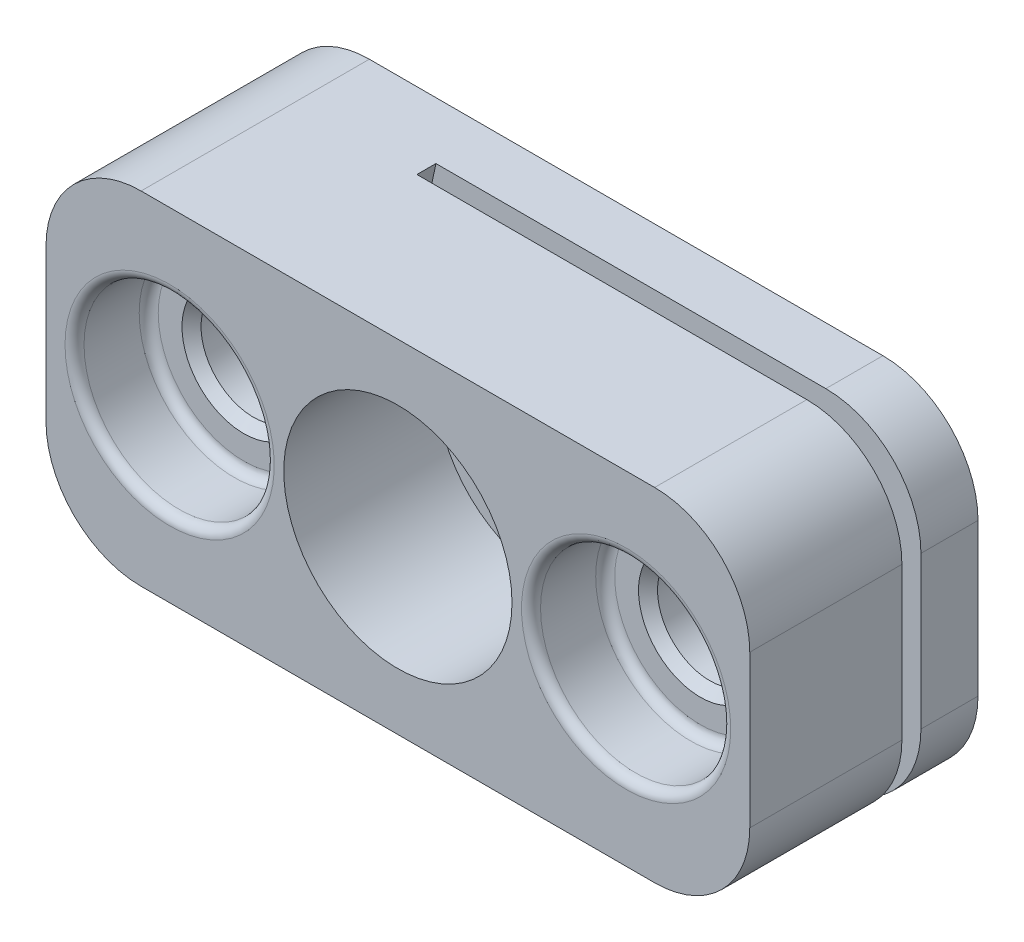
ISO-10303-21;
HEADER;
FILE_DESCRIPTION(('STEP AP214'),'2;1');
FILE_NAME('part.step','',(''),(''),'','','');
FILE_SCHEMA(('AUTOMOTIVE_DESIGN { 1 0 10303 214 1 1 1 1 }'));
ENDSEC;
DATA;
#1=APPLICATION_CONTEXT('core data for automotive mechanical design processes');
#2=APPLICATION_PROTOCOL_DEFINITION('international standard','automotive_design',2000,#1);
#3=PRODUCT_CONTEXT('',#1,'mechanical');
#4=PRODUCT('Part','Part','',(#3));
#5=PRODUCT_RELATED_PRODUCT_CATEGORY('part','',(#4));
#6=PRODUCT_DEFINITION_FORMATION('','',#4);
#7=PRODUCT_DEFINITION_CONTEXT('part definition',#1,'design');
#8=PRODUCT_DEFINITION('design','',#6,#7);
#9=PRODUCT_DEFINITION_SHAPE('','',#8);
#10=(LENGTH_UNIT() NAMED_UNIT(*) SI_UNIT(.MILLI.,.METRE.));
#11=(NAMED_UNIT(*) PLANE_ANGLE_UNIT() SI_UNIT($,.RADIAN.));
#12=(NAMED_UNIT(*) SI_UNIT($,.STERADIAN.) SOLID_ANGLE_UNIT());
#13=UNCERTAINTY_MEASURE_WITH_UNIT(LENGTH_MEASURE(1.E-05),#10,'distance_accuracy_value','');
#14=(GEOMETRIC_REPRESENTATION_CONTEXT(3) GLOBAL_UNCERTAINTY_ASSIGNED_CONTEXT((#13)) GLOBAL_UNIT_ASSIGNED_CONTEXT((#10,
#11,#12)) REPRESENTATION_CONTEXT('',''));
#15=CARTESIAN_POINT('',(0.,0.,0.));
#16=DIRECTION('',(0.,0.,1.));
#17=DIRECTION('',(1.,0.,0.));
#18=AXIS2_PLACEMENT_3D('',#15,#16,#17);
#19=CARTESIAN_POINT('',(27.25,0.,8.1));
#20=DIRECTION('',(0.,0.,1.));
#21=DIRECTION('',(1.,0.,0.));
#22=AXIS2_PLACEMENT_3D('',#19,#20,#21);
#23=PLANE('',#22);
#24=CARTESIAN_POINT('',(24.,0.,8.1000000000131));
#25=DIRECTION('',(0.,0.,1.));
#26=DIRECTION('',(1.,0.,0.));
#27=AXIS2_PLACEMENT_3D('',#24,#25,#26);
#28=CIRCLE('',#27,3.24999999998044);
#29=CARTESIAN_POINT('',(27.2499999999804,0.,8.1000000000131));
#30=VERTEX_POINT('',#29);
#31=EDGE_CURVE('E18',#30,#30,#28,.F.);
#32=ORIENTED_EDGE('',*,*,#31,.T.);
#33=EDGE_LOOP('',(#32));
#34=FACE_BOUND('',#33,.T.);
#35=CARTESIAN_POINT('',(24.,0.,8.09999999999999));
#36=DIRECTION('',(0.,0.,-1.));
#37=DIRECTION('',(1.,0.,0.));
#38=AXIS2_PLACEMENT_3D('',#35,#36,#37);
#39=CIRCLE('',#38,4.50000000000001);
#40=CARTESIAN_POINT('',(28.5,0.,8.09999999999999));
#41=VERTEX_POINT('',#40);
#42=EDGE_CURVE('E285',#41,#41,#39,.F.);
#43=ORIENTED_EDGE('',*,*,#42,.T.);
#44=EDGE_LOOP('',(#43));
#45=FACE_BOUND('',#44,.T.);
#46=ADVANCED_FACE('F14',(#34,#45),#23,.T.);
#47=CARTESIAN_POINT('',(24.,0.,8.6));
#48=DIRECTION('',(0.,0.,1.));
#49=DIRECTION('',(1.,0.,0.));
#50=AXIS2_PLACEMENT_3D('',#47,#48,#49);
#51=TOROIDAL_SURFACE('',#50,4.5,0.500000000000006);
#52=CARTESIAN_POINT('',(24.,0.,8.6));
#53=DIRECTION('',(0.,0.,-1.));
#54=DIRECTION('',(-1.,0.,0.));
#55=AXIS2_PLACEMENT_3D('',#52,#53,#54);
#56=CIRCLE('',#55,5.);
#57=CARTESIAN_POINT('',(19.,0.,8.6));
#58=VERTEX_POINT('',#57);
#59=EDGE_CURVE('E234',#58,#58,#56,.F.);
#60=ORIENTED_EDGE('',*,*,#59,.T.);
#61=EDGE_LOOP('',(#60));
#62=FACE_BOUND('',#61,.T.);
#63=ORIENTED_EDGE('',*,*,#42,.F.);
#64=EDGE_LOOP('',(#63));
#65=FACE_BOUND('',#64,.T.);
#66=ADVANCED_FACE('F267',(#62,#65),#51,.F.);
#67=CARTESIAN_POINT('',(0.,0.,8.6));
#68=DIRECTION('',(0.,0.,-1.));
#69=DIRECTION('',(-1.,0.,0.));
#70=AXIS2_PLACEMENT_3D('',#67,#68,#69);
#71=TOROIDAL_SURFACE('',#70,4.5,0.500000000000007);
#72=CARTESIAN_POINT('',(0.,0.,8.09999999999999));
#73=DIRECTION('',(0.,0.,-1.));
#74=DIRECTION('',(-1.,0.,0.));
#75=AXIS2_PLACEMENT_3D('',#72,#73,#74);
#76=CIRCLE('',#75,4.50000000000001);
#77=CARTESIAN_POINT('',(-4.50000000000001,0.,8.09999999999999));
#78=VERTEX_POINT('',#77);
#79=EDGE_CURVE('E245',#78,#78,#76,.F.);
#80=ORIENTED_EDGE('',*,*,#79,.F.);
#81=EDGE_LOOP('',(#80));
#82=FACE_BOUND('',#81,.T.);
#83=CARTESIAN_POINT('',(0.,0.,8.6));
#84=DIRECTION('',(0.,0.,1.));
#85=DIRECTION('',(1.,0.,0.));
#86=AXIS2_PLACEMENT_3D('',#83,#84,#85);
#87=CIRCLE('',#86,5.);
#88=CARTESIAN_POINT('',(5.,0.,8.6));
#89=VERTEX_POINT('',#88);
#90=EDGE_CURVE('E231',#89,#89,#87,.T.);
#91=ORIENTED_EDGE('',*,*,#90,.T.);
#92=EDGE_LOOP('',(#91));
#93=FACE_BOUND('',#92,.T.);
#94=ADVANCED_FACE('F263',(#82,#93),#71,.F.);
#95=CARTESIAN_POINT('',(-4.5,0.,8.1));
#96=DIRECTION('',(0.,0.,1.));
#97=DIRECTION('',(1.,0.,0.));
#98=AXIS2_PLACEMENT_3D('',#95,#96,#97);
#99=PLANE('',#98);
#100=ORIENTED_EDGE('',*,*,#79,.T.);
#101=EDGE_LOOP('',(#100));
#102=FACE_BOUND('',#101,.T.);
#103=CARTESIAN_POINT('',(0.,0.,8.1000000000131));
#104=DIRECTION('',(0.,0.,1.));
#105=DIRECTION('',(1.,0.,0.));
#106=AXIS2_PLACEMENT_3D('',#103,#104,#105);
#107=CIRCLE('',#106,3.25000000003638);
#108=CARTESIAN_POINT('',(3.25000000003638,0.,8.1000000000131));
#109=VERTEX_POINT('',#108);
#110=EDGE_CURVE('E228',#109,#109,#107,.F.);
#111=ORIENTED_EDGE('',*,*,#110,.T.);
#112=EDGE_LOOP('',(#111));
#113=FACE_BOUND('',#112,.T.);
#114=ADVANCED_FACE('F252',(#102,#113),#99,.T.);
#115=CARTESIAN_POINT('',(24.,0.,8.1000000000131));
#116=DIRECTION('',(0.,0.,1.));
#117=DIRECTION('',(1.,0.,0.));
#118=AXIS2_PLACEMENT_3D('',#115,#116,#117);
#119=CONICAL_SURFACE('',#118,3.24999999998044,0.785398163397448);
#120=CARTESIAN_POINT('',(24.,0.,7.6));
#121=DIRECTION('',(0.,0.,-1.));
#122=DIRECTION('',(-1.,0.,0.));
#123=AXIS2_PLACEMENT_3D('',#120,#121,#122);
#124=CIRCLE('',#123,2.75);
#125=CARTESIAN_POINT('',(21.25,0.,7.6));
#126=VERTEX_POINT('',#125);
#127=EDGE_CURVE('E224',#126,#126,#124,.T.);
#128=ORIENTED_EDGE('',*,*,#127,.T.);
#129=EDGE_LOOP('',(#128));
#130=FACE_BOUND('',#129,.T.);
#131=ORIENTED_EDGE('',*,*,#31,.F.);
#132=EDGE_LOOP('',(#131));
#133=FACE_BOUND('',#132,.T.);
#134=ADVANCED_FACE('F262',(#130,#133),#119,.F.);
#135=CARTESIAN_POINT('',(24.,0.,12.));
#136=DIRECTION('',(0.,0.,-1.));
#137=DIRECTION('',(-1.,0.,0.));
#138=AXIS2_PLACEMENT_3D('',#135,#136,#137);
#139=CYLINDRICAL_SURFACE('',#138,5.);
#140=ORIENTED_EDGE('',*,*,#59,.F.);
#141=EDGE_LOOP('',(#140));
#142=FACE_BOUND('',#141,.T.);
#143=CARTESIAN_POINT('',(24.,0.,11.5));
#144=DIRECTION('',(0.,0.,1.));
#145=DIRECTION('',(1.,0.,0.));
#146=AXIS2_PLACEMENT_3D('',#143,#144,#145);
#147=CIRCLE('',#146,5.);
#148=CARTESIAN_POINT('',(29.,0.,11.5));
#149=VERTEX_POINT('',#148);
#150=EDGE_CURVE('E125',#149,#149,#147,.F.);
#151=ORIENTED_EDGE('',*,*,#150,.F.);
#152=EDGE_LOOP('',(#151));
#153=FACE_BOUND('',#152,.T.);
#154=ADVANCED_FACE('F505',(#142,#153),#139,.F.);
#155=CARTESIAN_POINT('',(0.,0.,0.));
#156=DIRECTION('',(0.,0.,1.));
#157=DIRECTION('',(1.,0.,0.));
#158=AXIS2_PLACEMENT_3D('',#155,#156,#157);
#159=CYLINDRICAL_SURFACE('',#158,5.);
#160=CARTESIAN_POINT('',(0.,0.,11.5));
#161=DIRECTION('',(0.,0.,-1.));
#162=DIRECTION('',(-1.,0.,0.));
#163=AXIS2_PLACEMENT_3D('',#160,#161,#162);
#164=CIRCLE('',#163,5.);
#165=CARTESIAN_POINT('',(-5.,0.,11.5));
#166=VERTEX_POINT('',#165);
#167=EDGE_CURVE('E171',#166,#166,#164,.T.);
#168=ORIENTED_EDGE('',*,*,#167,.F.);
#169=EDGE_LOOP('',(#168));
#170=FACE_BOUND('',#169,.T.);
#171=ORIENTED_EDGE('',*,*,#90,.F.);
#172=EDGE_LOOP('',(#171));
#173=FACE_BOUND('',#172,.T.);
#174=ADVANCED_FACE('F349',(#170,#173),#159,.F.);
#175=CARTESIAN_POINT('',(0.,0.,8.1000000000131));
#176=DIRECTION('',(0.,0.,1.));
#177=DIRECTION('',(1.,0.,0.));
#178=AXIS2_PLACEMENT_3D('',#175,#176,#177);
#179=CONICAL_SURFACE('',#178,3.25000000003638,0.785398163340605);
#180=ORIENTED_EDGE('',*,*,#110,.F.);
#181=EDGE_LOOP('',(#180));
#182=FACE_BOUND('',#181,.T.);
#183=CARTESIAN_POINT('',(0.,0.,7.6));
#184=DIRECTION('',(0.,0.,1.));
#185=DIRECTION('',(1.,0.,0.));
#186=AXIS2_PLACEMENT_3D('',#183,#184,#185);
#187=CIRCLE('',#186,2.75);
#188=CARTESIAN_POINT('',(2.75,0.,7.6));
#189=VERTEX_POINT('',#188);
#190=EDGE_CURVE('E167',#189,#189,#187,.F.);
#191=ORIENTED_EDGE('',*,*,#190,.T.);
#192=EDGE_LOOP('',(#191));
#193=FACE_BOUND('',#192,.T.);
#194=ADVANCED_FACE('F345',(#182,#193),#179,.F.);
#195=CARTESIAN_POINT('',(24.,0.,12.));
#196=DIRECTION('',(0.,0.,-1.));
#197=DIRECTION('',(-1.,0.,0.));
#198=AXIS2_PLACEMENT_3D('',#195,#196,#197);
#199=CYLINDRICAL_SURFACE('',#198,2.75);
#200=CARTESIAN_POINT('',(24.,0.,4.));
#201=DIRECTION('',(0.,0.,-1.));
#202=DIRECTION('',(-1.,0.,0.));
#203=AXIS2_PLACEMENT_3D('',#200,#201,#202);
#204=CIRCLE('',#203,2.75);
#205=CARTESIAN_POINT('',(21.25,0.,4.));
#206=VERTEX_POINT('',#205);
#207=EDGE_CURVE('E135',#206,#206,#204,.T.);
#208=ORIENTED_EDGE('',*,*,#207,.T.);
#209=EDGE_LOOP('',(#208));
#210=FACE_BOUND('',#209,.T.);
#211=ORIENTED_EDGE('',*,*,#127,.F.);
#212=EDGE_LOOP('',(#211));
#213=FACE_BOUND('',#212,.T.);
#214=ADVANCED_FACE('F348',(#210,#213),#199,.F.);
#215=CARTESIAN_POINT('',(43.9743505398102,0.,4.));
#216=DIRECTION('',(0.,0.,1.));
#217=DIRECTION('',(1.,0.,0.));
#218=AXIS2_PLACEMENT_3D('',#215,#216,#217);
#219=CYLINDRICAL_SURFACE('',#218,40.);
#220=DIRECTION('',(0.,0.,1.));
#221=VECTOR('',#220,1.);
#222=CARTESIAN_POINT('',(5.,9.,4.));
#223=LINE('',#222,#221);
#224=CARTESIAN_POINT('',(5.,9.,4.));
#225=VERTEX_POINT('',#224);
#226=CARTESIAN_POINT('',(5.,9.,3.));
#227=VERTEX_POINT('',#226);
#228=EDGE_CURVE('E113',#225,#227,#223,.F.);
#229=ORIENTED_EDGE('',*,*,#228,.F.);
#230=CARTESIAN_POINT('',(43.9743505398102,0.,4.));
#231=DIRECTION('',(0.,0.,1.));
#232=DIRECTION('',(1.,0.,0.));
#233=AXIS2_PLACEMENT_3D('',#230,#231,#232);
#234=CIRCLE('',#233,40.);
#235=CARTESIAN_POINT('',(5.,-9.,4.));
#236=VERTEX_POINT('',#235);
#237=EDGE_CURVE('E177',#225,#236,#234,.T.);
#238=ORIENTED_EDGE('',*,*,#237,.T.);
#239=DIRECTION('',(0.,0.,1.));
#240=VECTOR('',#239,1.);
#241=CARTESIAN_POINT('',(5.,-9.,4.));
#242=LINE('',#241,#240);
#243=CARTESIAN_POINT('',(5.,-9.,3.));
#244=VERTEX_POINT('',#243);
#245=EDGE_CURVE('E126',#244,#236,#242,.T.);
#246=ORIENTED_EDGE('',*,*,#245,.F.);
#247=CARTESIAN_POINT('',(43.9743505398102,0.,3.));
#248=DIRECTION('',(0.,0.,1.));
#249=DIRECTION('',(1.,0.,0.));
#250=AXIS2_PLACEMENT_3D('',#247,#248,#249);
#251=CIRCLE('',#250,40.);
#252=EDGE_CURVE('E130',#227,#244,#251,.T.);
#253=ORIENTED_EDGE('',*,*,#252,.F.);
#254=EDGE_LOOP('',(#229,#238,#246,#253));
#255=FACE_BOUND('',#254,.T.);
#256=ADVANCED_FACE('F131',(#255),#219,.F.);
#257=CARTESIAN_POINT('',(24.,0.,11.5));
#258=DIRECTION('',(0.,0.,1.));
#259=DIRECTION('',(1.,0.,0.));
#260=AXIS2_PLACEMENT_3D('',#257,#258,#259);
#261=TOROIDAL_SURFACE('',#260,5.5,0.5);
#262=ORIENTED_EDGE('',*,*,#150,.T.);
#263=EDGE_LOOP('',(#262));
#264=FACE_BOUND('',#263,.T.);
#265=CARTESIAN_POINT('',(24.,0.,12.));
#266=DIRECTION('',(0.,0.,1.));
#267=DIRECTION('',(1.,0.,0.));
#268=AXIS2_PLACEMENT_3D('',#265,#266,#267);
#269=CIRCLE('',#268,5.5);
#270=CARTESIAN_POINT('',(29.5,0.,12.));
#271=VERTEX_POINT('',#270);
#272=EDGE_CURVE('E215',#271,#271,#269,.F.);
#273=ORIENTED_EDGE('',*,*,#272,.F.);
#274=EDGE_LOOP('',(#273));
#275=FACE_BOUND('',#274,.T.);
#276=ADVANCED_FACE('F189',(#264,#275),#261,.T.);
#277=CARTESIAN_POINT('',(0.,0.,11.5));
#278=DIRECTION('',(0.,0.,-1.));
#279=DIRECTION('',(-1.,0.,0.));
#280=AXIS2_PLACEMENT_3D('',#277,#278,#279);
#281=TOROIDAL_SURFACE('',#280,5.5,0.5);
#282=CARTESIAN_POINT('',(0.,0.,12.));
#283=DIRECTION('',(0.,0.,1.));
#284=DIRECTION('',(-1.,0.,0.));
#285=AXIS2_PLACEMENT_3D('',#282,#283,#284);
#286=CIRCLE('',#285,5.5);
#287=CARTESIAN_POINT('',(-5.5,0.,12.));
#288=VERTEX_POINT('',#287);
#289=EDGE_CURVE('E331',#288,#288,#286,.F.);
#290=ORIENTED_EDGE('',*,*,#289,.F.);
#291=EDGE_LOOP('',(#290));
#292=FACE_BOUND('',#291,.T.);
#293=ORIENTED_EDGE('',*,*,#167,.T.);
#294=EDGE_LOOP('',(#293));
#295=FACE_BOUND('',#294,.T.);
#296=ADVANCED_FACE('F183',(#292,#295),#281,.T.);
#297=CARTESIAN_POINT('',(30.5,-4.,12.));
#298=DIRECTION('',(-1.,0.,0.));
#299=DIRECTION('',(0.,0.,1.));
#300=AXIS2_PLACEMENT_3D('',#297,#298,#299);
#301=PLANE('',#300);
#302=DIRECTION('',(0.,1.,0.));
#303=VECTOR('',#302,1.);
#304=CARTESIAN_POINT('',(30.5,0.,4.));
#305=LINE('',#304,#303);
#306=CARTESIAN_POINT('',(30.5,-4.,4.));
#307=VERTEX_POINT('',#306);
#308=CARTESIAN_POINT('',(30.5,4.,4.));
#309=VERTEX_POINT('',#308);
#310=EDGE_CURVE('E334',#307,#309,#305,.T.);
#311=ORIENTED_EDGE('',*,*,#310,.T.);
#312=DIRECTION('',(0.,0.,1.));
#313=VECTOR('',#312,1.);
#314=CARTESIAN_POINT('',(30.5,4.,12.));
#315=LINE('',#314,#313);
#316=CARTESIAN_POINT('',(30.5,4.,12.));
#317=VERTEX_POINT('',#316);
#318=EDGE_CURVE('E174',#317,#309,#315,.F.);
#319=ORIENTED_EDGE('',*,*,#318,.F.);
#320=DIRECTION('',(0.,1.,0.));
#321=VECTOR('',#320,1.);
#322=CARTESIAN_POINT('',(30.5,-4.,12.));
#323=LINE('',#322,#321);
#324=CARTESIAN_POINT('',(30.5,-4.,12.));
#325=VERTEX_POINT('',#324);
#326=EDGE_CURVE('E327',#325,#317,#323,.T.);
#327=ORIENTED_EDGE('',*,*,#326,.F.);
#328=DIRECTION('',(0.,0.,1.));
#329=VECTOR('',#328,1.);
#330=CARTESIAN_POINT('',(30.5,-4.,12.));
#331=LINE('',#330,#329);
#332=EDGE_CURVE('E170',#307,#325,#331,.T.);
#333=ORIENTED_EDGE('',*,*,#332,.F.);
#334=EDGE_LOOP('',(#311,#319,#327,#333));
#335=FACE_BOUND('',#334,.T.);
#336=ADVANCED_FACE('F188',(#335),#301,.F.);
#337=CARTESIAN_POINT('',(24.,0.,12.));
#338=DIRECTION('',(0.,0.,-1.));
#339=DIRECTION('',(-1.,0.,0.));
#340=AXIS2_PLACEMENT_3D('',#337,#338,#339);
#341=CYLINDRICAL_SURFACE('',#340,2.75);
#342=CARTESIAN_POINT('',(24.,0.,0.499999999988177));
#343=DIRECTION('',(0.,0.,-1.));
#344=DIRECTION('',(-1.,0.,0.));
#345=AXIS2_PLACEMENT_3D('',#342,#343,#344);
#346=CIRCLE('',#345,2.74999999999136);
#347=CARTESIAN_POINT('',(21.2500000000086,0.,0.499999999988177));
#348=VERTEX_POINT('',#347);
#349=EDGE_CURVE('E326',#348,#348,#346,.T.);
#350=ORIENTED_EDGE('',*,*,#349,.T.);
#351=EDGE_LOOP('',(#350));
#352=FACE_BOUND('',#351,.T.);
#353=CARTESIAN_POINT('',(24.,0.,3.));
#354=DIRECTION('',(0.,0.,-1.));
#355=DIRECTION('',(-1.,0.,0.));
#356=AXIS2_PLACEMENT_3D('',#353,#354,#355);
#357=CIRCLE('',#356,2.75);
#358=CARTESIAN_POINT('',(21.25,0.,3.));
#359=VERTEX_POINT('',#358);
#360=EDGE_CURVE('E136',#359,#359,#357,.T.);
#361=ORIENTED_EDGE('',*,*,#360,.F.);
#362=EDGE_LOOP('',(#361));
#363=FACE_BOUND('',#362,.T.);
#364=ADVANCED_FACE('F357',(#352,#363),#341,.F.);
#365=CARTESIAN_POINT('',(0.,0.,0.));
#366=DIRECTION('',(0.,0.,1.));
#367=DIRECTION('',(1.,0.,0.));
#368=AXIS2_PLACEMENT_3D('',#365,#366,#367);
#369=CYLINDRICAL_SURFACE('',#368,2.75);
#370=ORIENTED_EDGE('',*,*,#190,.F.);
#371=EDGE_LOOP('',(#370));
#372=FACE_BOUND('',#371,.T.);
#373=CARTESIAN_POINT('',(0.,0.,0.50000000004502));
#374=DIRECTION('',(0.,0.,-1.));
#375=DIRECTION('',(-1.,0.,0.));
#376=AXIS2_PLACEMENT_3D('',#373,#374,#375);
#377=CIRCLE('',#376,2.74999999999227);
#378=CARTESIAN_POINT('',(-2.74999999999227,0.,0.50000000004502));
#379=VERTEX_POINT('',#378);
#380=EDGE_CURVE('E323',#379,#379,#377,.T.);
#381=ORIENTED_EDGE('',*,*,#380,.T.);
#382=EDGE_LOOP('',(#381));
#383=FACE_BOUND('',#382,.T.);
#384=ADVANCED_FACE('F353',(#372,#383),#369,.F.);
#385=CARTESIAN_POINT('',(25.5,-4.,12.));
#386=DIRECTION('',(0.,0.,1.));
#387=DIRECTION('',(1.,0.,0.));
#388=AXIS2_PLACEMENT_3D('',#385,#386,#387);
#389=CYLINDRICAL_SURFACE('',#388,5.);
#390=ORIENTED_EDGE('',*,*,#332,.T.);
#391=CARTESIAN_POINT('',(25.5,-4.,12.));
#392=DIRECTION('',(0.,0.,1.));
#393=DIRECTION('',(1.,0.,0.));
#394=AXIS2_PLACEMENT_3D('',#391,#392,#393);
#395=CIRCLE('',#394,5.);
#396=CARTESIAN_POINT('',(25.5,-9.,12.));
#397=VERTEX_POINT('',#396);
#398=EDGE_CURVE('E328',#397,#325,#395,.T.);
#399=ORIENTED_EDGE('',*,*,#398,.F.);
#400=DIRECTION('',(0.,0.,1.));
#401=VECTOR('',#400,1.);
#402=CARTESIAN_POINT('',(25.5,-9.,12.));
#403=LINE('',#402,#401);
#404=CARTESIAN_POINT('',(25.5,-9.,4.));
#405=VERTEX_POINT('',#404);
#406=EDGE_CURVE('E157',#397,#405,#403,.F.);
#407=ORIENTED_EDGE('',*,*,#406,.T.);
#408=CARTESIAN_POINT('',(25.5,-4.,4.));
#409=DIRECTION('',(0.,0.,1.));
#410=DIRECTION('',(1.,0.,0.));
#411=AXIS2_PLACEMENT_3D('',#408,#409,#410);
#412=CIRCLE('',#411,5.);
#413=EDGE_CURVE('E335',#405,#307,#412,.T.);
#414=ORIENTED_EDGE('',*,*,#413,.T.);
#415=EDGE_LOOP('',(#390,#399,#407,#414));
#416=FACE_BOUND('',#415,.T.);
#417=ADVANCED_FACE('F356',(#416),#389,.T.);
#418=CARTESIAN_POINT('',(43.9743505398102,0.,3.));
#419=DIRECTION('',(0.,0.,1.));
#420=DIRECTION('',(1.,0.,0.));
#421=AXIS2_PLACEMENT_3D('',#418,#419,#420);
#422=PLANE('',#421);
#423=CARTESIAN_POINT('',(12.,0.,3.));
#424=DIRECTION('',(0.,0.,1.));
#425=DIRECTION('',(1.,0.,0.));
#426=AXIS2_PLACEMENT_3D('',#423,#424,#425);
#427=CIRCLE('',#426,6.00000000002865);
#428=CARTESIAN_POINT('',(18.0000000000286,0.,3.));
#429=VERTEX_POINT('',#428);
#430=EDGE_CURVE('E455',#429,#429,#427,.T.);
#431=ORIENTED_EDGE('',*,*,#430,.F.);
#432=EDGE_LOOP('',(#431));
#433=FACE_BOUND('',#432,.T.);
#434=ORIENTED_EDGE('',*,*,#252,.T.);
#435=DIRECTION('',(1.,0.,0.));
#436=VECTOR('',#435,1.);
#437=CARTESIAN_POINT('',(-1.5,-9.,3.));
#438=LINE('',#437,#436);
#439=CARTESIAN_POINT('',(25.5,-9.,3.));
#440=VERTEX_POINT('',#439);
#441=EDGE_CURVE('E153',#244,#440,#438,.T.);
#442=ORIENTED_EDGE('',*,*,#441,.T.);
#443=CARTESIAN_POINT('',(25.5,-4.,3.));
#444=DIRECTION('',(0.,0.,1.));
#445=DIRECTION('',(1.,0.,0.));
#446=AXIS2_PLACEMENT_3D('',#443,#444,#445);
#447=CIRCLE('',#446,5.);
#448=CARTESIAN_POINT('',(30.5,-4.,3.));
#449=VERTEX_POINT('',#448);
#450=EDGE_CURVE('E164',#449,#440,#447,.F.);
#451=ORIENTED_EDGE('',*,*,#450,.F.);
#452=DIRECTION('',(0.,1.,0.));
#453=VECTOR('',#452,1.);
#454=CARTESIAN_POINT('',(30.5,-4.,3.));
#455=LINE('',#454,#453);
#456=CARTESIAN_POINT('',(30.5,4.,3.));
#457=VERTEX_POINT('',#456);
#458=EDGE_CURVE('E150',#449,#457,#455,.T.);
#459=ORIENTED_EDGE('',*,*,#458,.T.);
#460=CARTESIAN_POINT('',(25.5,4.,3.));
#461=DIRECTION('',(0.,0.,1.));
#462=DIRECTION('',(1.,0.,0.));
#463=AXIS2_PLACEMENT_3D('',#460,#461,#462);
#464=CIRCLE('',#463,5.);
#465=CARTESIAN_POINT('',(25.5,9.,3.));
#466=VERTEX_POINT('',#465);
#467=EDGE_CURVE('E141',#466,#457,#464,.F.);
#468=ORIENTED_EDGE('',*,*,#467,.F.);
#469=DIRECTION('',(1.,0.,0.));
#470=VECTOR('',#469,1.);
#471=CARTESIAN_POINT('',(25.5,9.,3.));
#472=LINE('',#471,#470);
#473=EDGE_CURVE('E117',#466,#227,#472,.F.);
#474=ORIENTED_EDGE('',*,*,#473,.T.);
#475=EDGE_LOOP('',(#434,#442,#451,#459,#468,#474));
#476=FACE_BOUND('',#475,.T.);
#477=ORIENTED_EDGE('',*,*,#360,.T.);
#478=EDGE_LOOP('',(#477));
#479=FACE_BOUND('',#478,.T.);
#480=ADVANCED_FACE('F138',(#433,#476,#479),#422,.T.);
#481=CARTESIAN_POINT('',(43.9743505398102,0.,4.));
#482=DIRECTION('',(0.,0.,1.));
#483=DIRECTION('',(1.,0.,0.));
#484=AXIS2_PLACEMENT_3D('',#481,#482,#483);
#485=PLANE('',#484);
#486=CARTESIAN_POINT('',(12.,0.,4.));
#487=DIRECTION('',(0.,0.,1.));
#488=DIRECTION('',(1.,0.,0.));
#489=AXIS2_PLACEMENT_3D('',#486,#487,#488);
#490=CIRCLE('',#489,6.00000000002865);
#491=CARTESIAN_POINT('',(18.0000000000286,0.,4.));
#492=VERTEX_POINT('',#491);
#493=EDGE_CURVE('E458',#492,#492,#490,.T.);
#494=ORIENTED_EDGE('',*,*,#493,.T.);
#495=EDGE_LOOP('',(#494));
#496=FACE_BOUND('',#495,.T.);
#497=ORIENTED_EDGE('',*,*,#237,.F.);
#498=DIRECTION('',(1.,0.,0.));
#499=VECTOR('',#498,1.);
#500=CARTESIAN_POINT('',(25.5,9.,4.));
#501=LINE('',#500,#499);
#502=CARTESIAN_POINT('',(25.5,9.,4.));
#503=VERTEX_POINT('',#502);
#504=EDGE_CURVE('E121',#225,#503,#501,.T.);
#505=ORIENTED_EDGE('',*,*,#504,.T.);
#506=CARTESIAN_POINT('',(25.5,4.,4.));
#507=DIRECTION('',(0.,0.,1.));
#508=DIRECTION('',(1.,0.,0.));
#509=AXIS2_PLACEMENT_3D('',#506,#507,#508);
#510=CIRCLE('',#509,5.);
#511=EDGE_CURVE('E176',#309,#503,#510,.T.);
#512=ORIENTED_EDGE('',*,*,#511,.F.);
#513=ORIENTED_EDGE('',*,*,#310,.F.);
#514=ORIENTED_EDGE('',*,*,#413,.F.);
#515=DIRECTION('',(1.,0.,0.));
#516=VECTOR('',#515,1.);
#517=CARTESIAN_POINT('',(-1.5,-9.,4.));
#518=LINE('',#517,#516);
#519=EDGE_CURVE('E160',#405,#236,#518,.F.);
#520=ORIENTED_EDGE('',*,*,#519,.T.);
#521=EDGE_LOOP('',(#497,#505,#512,#513,#514,#520));
#522=FACE_BOUND('',#521,.T.);
#523=ORIENTED_EDGE('',*,*,#207,.F.);
#524=EDGE_LOOP('',(#523));
#525=FACE_BOUND('',#524,.T.);
#526=ADVANCED_FACE('F418',(#496,#522,#525),#485,.F.);
#527=CARTESIAN_POINT('',(25.5,4.,12.));
#528=DIRECTION('',(0.,0.,1.));
#529=DIRECTION('',(1.,0.,0.));
#530=AXIS2_PLACEMENT_3D('',#527,#528,#529);
#531=CYLINDRICAL_SURFACE('',#530,5.);
#532=DIRECTION('',(0.,0.,-1.));
#533=VECTOR('',#532,1.);
#534=CARTESIAN_POINT('',(25.5,9.,12.));
#535=LINE('',#534,#533);
#536=CARTESIAN_POINT('',(25.5,9.,12.));
#537=VERTEX_POINT('',#536);
#538=EDGE_CURVE('E144',#503,#537,#535,.F.);
#539=ORIENTED_EDGE('',*,*,#538,.T.);
#540=CARTESIAN_POINT('',(25.5,4.,12.));
#541=DIRECTION('',(0.,0.,1.));
#542=DIRECTION('',(1.,0.,0.));
#543=AXIS2_PLACEMENT_3D('',#540,#541,#542);
#544=CIRCLE('',#543,5.);
#545=EDGE_CURVE('E324',#317,#537,#544,.T.);
#546=ORIENTED_EDGE('',*,*,#545,.F.);
#547=ORIENTED_EDGE('',*,*,#318,.T.);
#548=ORIENTED_EDGE('',*,*,#511,.T.);
#549=EDGE_LOOP('',(#539,#546,#547,#548));
#550=FACE_BOUND('',#549,.T.);
#551=ADVANCED_FACE('F394',(#550),#531,.T.);
#552=CARTESIAN_POINT('',(-1.5,-4.,12.));
#553=DIRECTION('',(0.,0.,1.));
#554=DIRECTION('',(1.,0.,0.));
#555=AXIS2_PLACEMENT_3D('',#552,#553,#554);
#556=PLANE('',#555);
#557=DIRECTION('',(1.,0.,0.));
#558=VECTOR('',#557,1.);
#559=CARTESIAN_POINT('',(25.5,9.,12.));
#560=LINE('',#559,#558);
#561=CARTESIAN_POINT('',(-1.5,9.,12.));
#562=VERTEX_POINT('',#561);
#563=EDGE_CURVE('E146',#537,#562,#560,.F.);
#564=ORIENTED_EDGE('',*,*,#563,.T.);
#565=CARTESIAN_POINT('',(-1.5,4.,12.));
#566=DIRECTION('',(0.,0.,1.));
#567=DIRECTION('',(1.,0.,0.));
#568=AXIS2_PLACEMENT_3D('',#565,#566,#567);
#569=CIRCLE('',#568,5.);
#570=CARTESIAN_POINT('',(-6.5,4.,12.));
#571=VERTEX_POINT('',#570);
#572=EDGE_CURVE('E315',#571,#562,#569,.F.);
#573=ORIENTED_EDGE('',*,*,#572,.F.);
#574=DIRECTION('',(0.,1.,0.));
#575=VECTOR('',#574,1.);
#576=CARTESIAN_POINT('',(-6.5,4.,12.));
#577=LINE('',#576,#575);
#578=CARTESIAN_POINT('',(-6.5,-4.,12.));
#579=VERTEX_POINT('',#578);
#580=EDGE_CURVE('E372',#571,#579,#577,.F.);
#581=ORIENTED_EDGE('',*,*,#580,.T.);
#582=CARTESIAN_POINT('',(-1.5,-4.,12.));
#583=DIRECTION('',(0.,0.,1.));
#584=DIRECTION('',(1.,0.,0.));
#585=AXIS2_PLACEMENT_3D('',#582,#583,#584);
#586=CIRCLE('',#585,5.);
#587=CARTESIAN_POINT('',(-1.5,-9.,12.));
#588=VERTEX_POINT('',#587);
#589=EDGE_CURVE('E156',#588,#579,#586,.F.);
#590=ORIENTED_EDGE('',*,*,#589,.F.);
#591=DIRECTION('',(1.,0.,0.));
#592=VECTOR('',#591,1.);
#593=CARTESIAN_POINT('',(-1.5,-9.,12.));
#594=LINE('',#593,#592);
#595=EDGE_CURVE('E161',#588,#397,#594,.T.);
#596=ORIENTED_EDGE('',*,*,#595,.T.);
#597=ORIENTED_EDGE('',*,*,#398,.T.);
#598=ORIENTED_EDGE('',*,*,#326,.T.);
#599=ORIENTED_EDGE('',*,*,#545,.T.);
#600=EDGE_LOOP('',(#564,#573,#581,#590,#596,#597,#598,#599));
#601=FACE_BOUND('',#600,.T.);
#602=CARTESIAN_POINT('',(12.,0.,12.));
#603=DIRECTION('',(0.,0.,1.));
#604=DIRECTION('',(1.,0.,0.));
#605=AXIS2_PLACEMENT_3D('',#602,#603,#604);
#606=CIRCLE('',#605,6.00000000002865);
#607=CARTESIAN_POINT('',(18.0000000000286,0.,12.));
#608=VERTEX_POINT('',#607);
#609=EDGE_CURVE('E462',#608,#608,#606,.T.);
#610=ORIENTED_EDGE('',*,*,#609,.F.);
#611=EDGE_LOOP('',(#610));
#612=FACE_BOUND('',#611,.T.);
#613=ORIENTED_EDGE('',*,*,#289,.T.);
#614=EDGE_LOOP('',(#613));
#615=FACE_BOUND('',#614,.T.);
#616=ORIENTED_EDGE('',*,*,#272,.T.);
#617=EDGE_LOOP('',(#616));
#618=FACE_BOUND('',#617,.T.);
#619=ADVANCED_FACE('F383',(#601,#612,#615,#618),#556,.T.);
#620=CARTESIAN_POINT('',(24.,0.,-1.13686837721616E-10));
#621=DIRECTION('',(0.,0.,-1.));
#622=DIRECTION('',(-1.,0.,0.));
#623=AXIS2_PLACEMENT_3D('',#620,#621,#622);
#624=CONICAL_SURFACE('',#623,3.25000000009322,0.785398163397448);
#625=CARTESIAN_POINT('',(24.,0.,-5.6843418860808E-11));
#626=DIRECTION('',(0.,0.,-1.));
#627=DIRECTION('',(-1.,0.,0.));
#628=AXIS2_PLACEMENT_3D('',#625,#626,#627);
#629=CIRCLE('',#628,3.25000000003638);
#630=CARTESIAN_POINT('',(20.7499999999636,0.,-5.6843418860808E-11));
#631=VERTEX_POINT('',#630);
#632=EDGE_CURVE('E311',#631,#631,#629,.T.);
#633=ORIENTED_EDGE('',*,*,#632,.T.);
#634=EDGE_LOOP('',(#633));
#635=FACE_BOUND('',#634,.T.);
#636=ORIENTED_EDGE('',*,*,#349,.F.);
#637=EDGE_LOOP('',(#636));
#638=FACE_BOUND('',#637,.T.);
#639=ADVANCED_FACE('F393',(#635,#638),#624,.F.);
#640=CARTESIAN_POINT('',(0.,0.,-5.6843418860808E-11));
#641=DIRECTION('',(0.,0.,-1.));
#642=DIRECTION('',(-1.,0.,0.));
#643=AXIS2_PLACEMENT_3D('',#640,#641,#642);
#644=CONICAL_SURFACE('',#643,3.25000000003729,0.785398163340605);
#645=ORIENTED_EDGE('',*,*,#380,.F.);
#646=EDGE_LOOP('',(#645));
#647=FACE_BOUND('',#646,.T.);
#648=CARTESIAN_POINT('',(0.,0.,0.));
#649=DIRECTION('',(0.,0.,-1.));
#650=DIRECTION('',(-1.,0.,0.));
#651=AXIS2_PLACEMENT_3D('',#648,#649,#650);
#652=CIRCLE('',#651,3.24999999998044);
#653=CARTESIAN_POINT('',(-3.24999999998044,0.,0.));
#654=VERTEX_POINT('',#653);
#655=EDGE_CURVE('E308',#654,#654,#652,.T.);
#656=ORIENTED_EDGE('',*,*,#655,.T.);
#657=EDGE_LOOP('',(#656));
#658=FACE_BOUND('',#657,.T.);
#659=ADVANCED_FACE('F633',(#647,#658),#644,.F.);
#660=CARTESIAN_POINT('',(-1.5,-4.,12.));
#661=DIRECTION('',(0.,0.,1.));
#662=DIRECTION('',(1.,0.,0.));
#663=AXIS2_PLACEMENT_3D('',#660,#661,#662);
#664=CYLINDRICAL_SURFACE('',#663,5.);
#665=ORIENTED_EDGE('',*,*,#589,.T.);
#666=DIRECTION('',(0.,0.,-1.));
#667=VECTOR('',#666,1.);
#668=CARTESIAN_POINT('',(-6.5,-4.,12.));
#669=LINE('',#668,#667);
#670=CARTESIAN_POINT('',(-6.5,-4.,0.));
#671=VERTEX_POINT('',#670);
#672=EDGE_CURVE('E314',#579,#671,#669,.T.);
#673=ORIENTED_EDGE('',*,*,#672,.T.);
#674=CARTESIAN_POINT('',(-1.5,-4.,0.));
#675=DIRECTION('',(0.,0.,1.));
#676=DIRECTION('',(1.,0.,0.));
#677=AXIS2_PLACEMENT_3D('',#674,#675,#676);
#678=CIRCLE('',#677,5.);
#679=CARTESIAN_POINT('',(-1.5,-9.,0.));
#680=VERTEX_POINT('',#679);
#681=EDGE_CURVE('E305',#671,#680,#678,.T.);
#682=ORIENTED_EDGE('',*,*,#681,.T.);
#683=DIRECTION('',(0.,0.,1.));
#684=VECTOR('',#683,1.);
#685=CARTESIAN_POINT('',(-1.5,-9.,12.));
#686=LINE('',#685,#684);
#687=EDGE_CURVE('E155',#680,#588,#686,.T.);
#688=ORIENTED_EDGE('',*,*,#687,.T.);
#689=EDGE_LOOP('',(#665,#673,#682,#688));
#690=FACE_BOUND('',#689,.T.);
#691=ADVANCED_FACE('F642',(#690),#664,.T.);
#692=CARTESIAN_POINT('',(-1.5,-9.,12.));
#693=DIRECTION('',(0.,1.,0.));
#694=DIRECTION('',(0.,0.,1.));
#695=AXIS2_PLACEMENT_3D('',#692,#693,#694);
#696=PLANE('',#695);
#697=ORIENTED_EDGE('',*,*,#519,.F.);
#698=ORIENTED_EDGE('',*,*,#406,.F.);
#699=ORIENTED_EDGE('',*,*,#595,.F.);
#700=ORIENTED_EDGE('',*,*,#687,.F.);
#701=DIRECTION('',(1.,0.,0.));
#702=VECTOR('',#701,1.);
#703=CARTESIAN_POINT('',(-1.5,-9.,0.));
#704=LINE('',#703,#702);
#705=CARTESIAN_POINT('',(25.5,-9.,0.));
#706=VERTEX_POINT('',#705);
#707=EDGE_CURVE('E304',#680,#706,#704,.T.);
#708=ORIENTED_EDGE('',*,*,#707,.T.);
#709=DIRECTION('',(0.,0.,1.));
#710=VECTOR('',#709,1.);
#711=CARTESIAN_POINT('',(25.5,-9.,12.));
#712=LINE('',#711,#710);
#713=EDGE_CURVE('E321',#440,#706,#712,.F.);
#714=ORIENTED_EDGE('',*,*,#713,.F.);
#715=ORIENTED_EDGE('',*,*,#441,.F.);
#716=ORIENTED_EDGE('',*,*,#245,.T.);
#717=EDGE_LOOP('',(#697,#698,#699,#700,#708,#714,#715,#716));
#718=FACE_BOUND('',#717,.T.);
#719=ADVANCED_FACE('F431',(#718),#696,.F.);
#720=CARTESIAN_POINT('',(25.5,-4.,12.));
#721=DIRECTION('',(0.,0.,1.));
#722=DIRECTION('',(1.,0.,0.));
#723=AXIS2_PLACEMENT_3D('',#720,#721,#722);
#724=CYLINDRICAL_SURFACE('',#723,5.);
#725=CARTESIAN_POINT('',(25.5,-4.,0.));
#726=DIRECTION('',(0.,0.,1.));
#727=DIRECTION('',(1.,0.,0.));
#728=AXIS2_PLACEMENT_3D('',#725,#726,#727);
#729=CIRCLE('',#728,5.);
#730=CARTESIAN_POINT('',(30.5,-4.,0.));
#731=VERTEX_POINT('',#730);
#732=EDGE_CURVE('E301',#706,#731,#729,.T.);
#733=ORIENTED_EDGE('',*,*,#732,.T.);
#734=DIRECTION('',(0.,0.,1.));
#735=VECTOR('',#734,1.);
#736=CARTESIAN_POINT('',(30.5,-4.,12.));
#737=LINE('',#736,#735);
#738=EDGE_CURVE('E152',#731,#449,#737,.T.);
#739=ORIENTED_EDGE('',*,*,#738,.T.);
#740=ORIENTED_EDGE('',*,*,#450,.T.);
#741=ORIENTED_EDGE('',*,*,#713,.T.);
#742=EDGE_LOOP('',(#733,#739,#740,#741));
#743=FACE_BOUND('',#742,.T.);
#744=ADVANCED_FACE('F443',(#743),#724,.T.);
#745=CARTESIAN_POINT('',(30.5,-4.,12.));
#746=DIRECTION('',(-1.,0.,0.));
#747=DIRECTION('',(0.,0.,1.));
#748=AXIS2_PLACEMENT_3D('',#745,#746,#747);
#749=PLANE('',#748);
#750=ORIENTED_EDGE('',*,*,#738,.F.);
#751=DIRECTION('',(0.,1.,0.));
#752=VECTOR('',#751,1.);
#753=CARTESIAN_POINT('',(30.5,-4.,0.));
#754=LINE('',#753,#752);
#755=CARTESIAN_POINT('',(30.5,4.,0.));
#756=VERTEX_POINT('',#755);
#757=EDGE_CURVE('E300',#731,#756,#754,.T.);
#758=ORIENTED_EDGE('',*,*,#757,.T.);
#759=DIRECTION('',(0.,0.,1.));
#760=VECTOR('',#759,1.);
#761=CARTESIAN_POINT('',(30.5,4.,12.));
#762=LINE('',#761,#760);
#763=EDGE_CURVE('E319',#457,#756,#762,.F.);
#764=ORIENTED_EDGE('',*,*,#763,.F.);
#765=ORIENTED_EDGE('',*,*,#458,.F.);
#766=EDGE_LOOP('',(#750,#758,#764,#765));
#767=FACE_BOUND('',#766,.T.);
#768=ADVANCED_FACE('F440',(#767),#749,.F.);
#769=CARTESIAN_POINT('',(25.5,4.,12.));
#770=DIRECTION('',(0.,0.,1.));
#771=DIRECTION('',(1.,0.,0.));
#772=AXIS2_PLACEMENT_3D('',#769,#770,#771);
#773=CYLINDRICAL_SURFACE('',#772,5.);
#774=CARTESIAN_POINT('',(25.5,4.,0.));
#775=DIRECTION('',(0.,0.,1.));
#776=DIRECTION('',(1.,0.,0.));
#777=AXIS2_PLACEMENT_3D('',#774,#775,#776);
#778=CIRCLE('',#777,5.);
#779=CARTESIAN_POINT('',(25.5,9.,0.));
#780=VERTEX_POINT('',#779);
#781=EDGE_CURVE('E297',#756,#780,#778,.T.);
#782=ORIENTED_EDGE('',*,*,#781,.T.);
#783=DIRECTION('',(0.,0.,-1.));
#784=VECTOR('',#783,1.);
#785=CARTESIAN_POINT('',(25.5,9.,12.));
#786=LINE('',#785,#784);
#787=EDGE_CURVE('E142',#780,#466,#786,.F.);
#788=ORIENTED_EDGE('',*,*,#787,.T.);
#789=ORIENTED_EDGE('',*,*,#467,.T.);
#790=ORIENTED_EDGE('',*,*,#763,.T.);
#791=EDGE_LOOP('',(#782,#788,#789,#790));
#792=FACE_BOUND('',#791,.T.);
#793=ADVANCED_FACE('F675',(#792),#773,.T.);
#794=CARTESIAN_POINT('',(25.5,9.,12.));
#795=DIRECTION('',(0.,-1.,0.));
#796=DIRECTION('',(0.,0.,-1.));
#797=AXIS2_PLACEMENT_3D('',#794,#795,#796);
#798=PLANE('',#797);
#799=ORIENTED_EDGE('',*,*,#504,.F.);
#800=ORIENTED_EDGE('',*,*,#228,.T.);
#801=ORIENTED_EDGE('',*,*,#473,.F.);
#802=ORIENTED_EDGE('',*,*,#787,.F.);
#803=DIRECTION('',(1.,0.,0.));
#804=VECTOR('',#803,1.);
#805=CARTESIAN_POINT('',(-1.5,9.,0.));
#806=LINE('',#805,#804);
#807=CARTESIAN_POINT('',(-1.5,9.,0.));
#808=VERTEX_POINT('',#807);
#809=EDGE_CURVE('E296',#780,#808,#806,.F.);
#810=ORIENTED_EDGE('',*,*,#809,.T.);
#811=DIRECTION('',(0.,0.,1.));
#812=VECTOR('',#811,1.);
#813=CARTESIAN_POINT('',(-1.5,9.,12.));
#814=LINE('',#813,#812);
#815=EDGE_CURVE('E317',#562,#808,#814,.F.);
#816=ORIENTED_EDGE('',*,*,#815,.F.);
#817=ORIENTED_EDGE('',*,*,#563,.F.);
#818=ORIENTED_EDGE('',*,*,#538,.F.);
#819=EDGE_LOOP('',(#799,#800,#801,#802,#810,#816,#817,#818));
#820=FACE_BOUND('',#819,.T.);
#821=ADVANCED_FACE('F115',(#820),#798,.F.);
#822=CARTESIAN_POINT('',(-1.5,4.,12.));
#823=DIRECTION('',(0.,0.,1.));
#824=DIRECTION('',(1.,0.,0.));
#825=AXIS2_PLACEMENT_3D('',#822,#823,#824);
#826=CYLINDRICAL_SURFACE('',#825,5.);
#827=ORIENTED_EDGE('',*,*,#572,.T.);
#828=ORIENTED_EDGE('',*,*,#815,.T.);
#829=CARTESIAN_POINT('',(-1.5,4.,0.));
#830=DIRECTION('',(0.,0.,1.));
#831=DIRECTION('',(1.,0.,0.));
#832=AXIS2_PLACEMENT_3D('',#829,#830,#831);
#833=CIRCLE('',#832,5.);
#834=CARTESIAN_POINT('',(-6.5,4.,0.));
#835=VERTEX_POINT('',#834);
#836=EDGE_CURVE('E24',#808,#835,#833,.T.);
#837=ORIENTED_EDGE('',*,*,#836,.T.);
#838=DIRECTION('',(0.,0.,-1.));
#839=VECTOR('',#838,1.);
#840=CARTESIAN_POINT('',(-6.5,4.,12.));
#841=LINE('',#840,#839);
#842=EDGE_CURVE('E32',#835,#571,#841,.F.);
#843=ORIENTED_EDGE('',*,*,#842,.T.);
#844=EDGE_LOOP('',(#827,#828,#837,#843));
#845=FACE_BOUND('',#844,.T.);
#846=ADVANCED_FACE('F693',(#845),#826,.T.);
#847=CARTESIAN_POINT('',(-6.5,4.,12.));
#848=DIRECTION('',(1.,0.,0.));
#849=DIRECTION('',(0.,0.,-1.));
#850=AXIS2_PLACEMENT_3D('',#847,#848,#849);
#851=PLANE('',#850);
#852=ORIENTED_EDGE('',*,*,#672,.F.);
#853=ORIENTED_EDGE('',*,*,#580,.F.);
#854=ORIENTED_EDGE('',*,*,#842,.F.);
#855=DIRECTION('',(0.,1.,0.));
#856=VECTOR('',#855,1.);
#857=CARTESIAN_POINT('',(-6.5,-4.,0.));
#858=LINE('',#857,#856);
#859=EDGE_CURVE('E9',#835,#671,#858,.F.);
#860=ORIENTED_EDGE('',*,*,#859,.T.);
#861=EDGE_LOOP('',(#852,#853,#854,#860));
#862=FACE_BOUND('',#861,.T.);
#863=ADVANCED_FACE('F482',(#862),#851,.F.);
#864=CARTESIAN_POINT('',(-1.5,-4.,0.));
#865=DIRECTION('',(0.,0.,1.));
#866=DIRECTION('',(1.,0.,0.));
#867=AXIS2_PLACEMENT_3D('',#864,#865,#866);
#868=PLANE('',#867);
#869=ORIENTED_EDGE('',*,*,#836,.F.);
#870=ORIENTED_EDGE('',*,*,#809,.F.);
#871=ORIENTED_EDGE('',*,*,#781,.F.);
#872=ORIENTED_EDGE('',*,*,#757,.F.);
#873=ORIENTED_EDGE('',*,*,#732,.F.);
#874=ORIENTED_EDGE('',*,*,#707,.F.);
#875=ORIENTED_EDGE('',*,*,#681,.F.);
#876=ORIENTED_EDGE('',*,*,#859,.F.);
#877=EDGE_LOOP('',(#869,#870,#871,#872,#873,#874,#875,#876));
#878=FACE_BOUND('',#877,.T.);
#879=CARTESIAN_POINT('',(12.,0.,-5.6843418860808E-11));
#880=DIRECTION('',(0.,0.,1.));
#881=DIRECTION('',(1.,0.,0.));
#882=AXIS2_PLACEMENT_3D('',#879,#880,#881);
#883=CIRCLE('',#882,6.00000000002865);
#884=CARTESIAN_POINT('',(18.0000000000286,0.,-5.6843418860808E-11));
#885=VERTEX_POINT('',#884);
#886=EDGE_CURVE('E461',#885,#885,#883,.T.);
#887=ORIENTED_EDGE('',*,*,#886,.T.);
#888=EDGE_LOOP('',(#887));
#889=FACE_BOUND('',#888,.T.);
#890=ORIENTED_EDGE('',*,*,#655,.F.);
#891=EDGE_LOOP('',(#890));
#892=FACE_BOUND('',#891,.T.);
#893=ORIENTED_EDGE('',*,*,#632,.F.);
#894=EDGE_LOOP('',(#893));
#895=FACE_BOUND('',#894,.T.);
#896=ADVANCED_FACE('F468',(#878,#889,#892,#895),#868,.F.);
#897=CARTESIAN_POINT('',(12.,0.,-5.6843418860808E-11));
#898=DIRECTION('',(0.,0.,1.));
#899=DIRECTION('',(1.,0.,0.));
#900=AXIS2_PLACEMENT_3D('',#897,#898,#899);
#901=CYLINDRICAL_SURFACE('',#900,6.00000000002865);
#902=ORIENTED_EDGE('',*,*,#430,.T.);
#903=EDGE_LOOP('',(#902));
#904=FACE_BOUND('',#903,.T.);
#905=ORIENTED_EDGE('',*,*,#886,.F.);
#906=EDGE_LOOP('',(#905));
#907=FACE_BOUND('',#906,.T.);
#908=ADVANCED_FACE('F471',(#904,#907),#901,.F.);
#909=ORIENTED_EDGE('',*,*,#609,.T.);
#910=EDGE_LOOP('',(#909));
#911=FACE_BOUND('',#910,.T.);
#912=ORIENTED_EDGE('',*,*,#493,.F.);
#913=EDGE_LOOP('',(#912));
#914=FACE_BOUND('',#913,.T.);
#915=ADVANCED_FACE('F473',(#911,#914),#901,.F.);
#916=CLOSED_SHELL('',(#46,#66,#94,#114,#134,#154,#174,#194,#214,#256,#276,#296,#336,#364,#384,
#417,#480,#526,#551,#619,#639,#659,#691,#719,#744,#768,#793,#821,#846,#863,#896,#908,#915));
#917=MANIFOLD_SOLID_BREP('B1',#916);
#918=ADVANCED_BREP_SHAPE_REPRESENTATION('',(#18,#917),#14);
#919=SHAPE_DEFINITION_REPRESENTATION(#9,#918);
ENDSEC;
END-ISO-10303-21;
